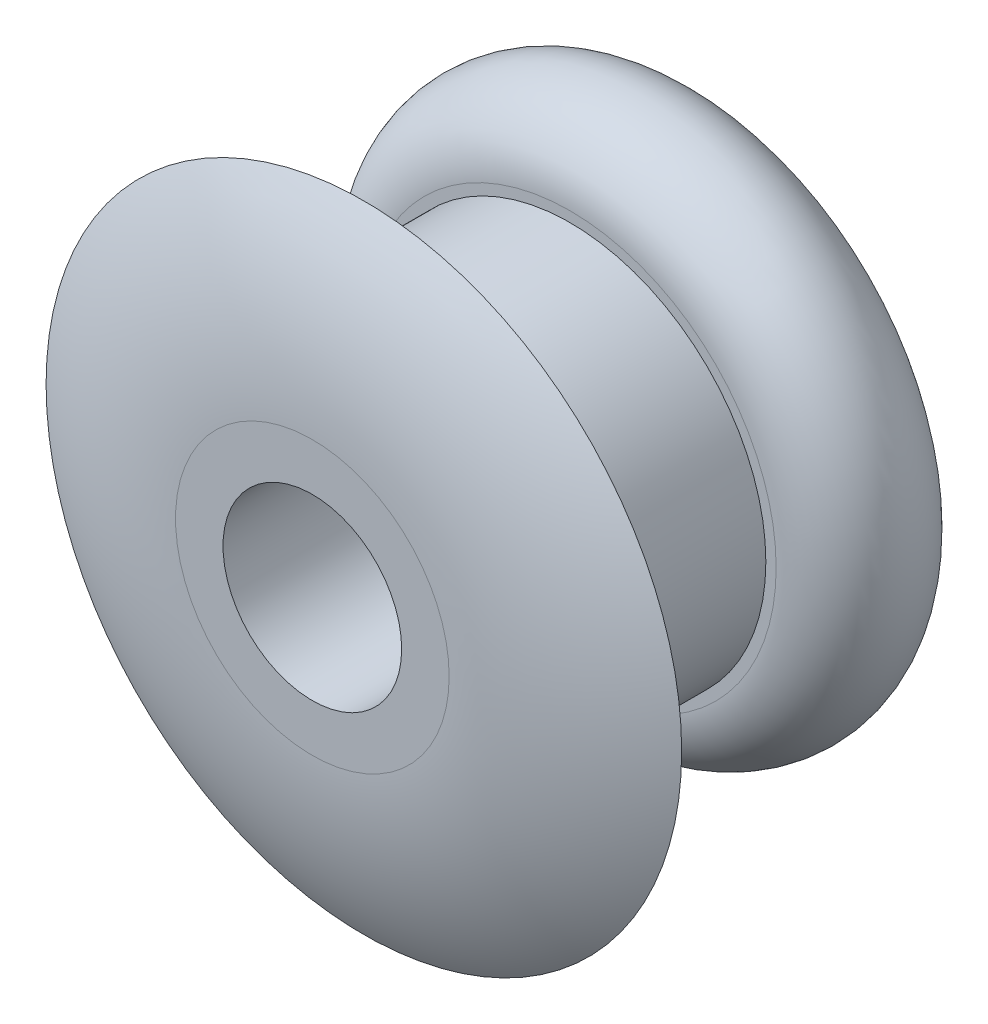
ISO-10303-21;
HEADER;
FILE_DESCRIPTION(('STEP AP214'),'2;1');
FILE_NAME('part.step','',(''),(''),'','','');
FILE_SCHEMA(('AUTOMOTIVE_DESIGN { 1 0 10303 214 1 1 1 1 }'));
ENDSEC;
DATA;
#1=APPLICATION_CONTEXT('core data for automotive mechanical design processes');
#2=APPLICATION_PROTOCOL_DEFINITION('international standard','automotive_design',2000,#1);
#3=PRODUCT_CONTEXT('',#1,'mechanical');
#4=PRODUCT('Part','Part','',(#3));
#5=PRODUCT_RELATED_PRODUCT_CATEGORY('part','',(#4));
#6=PRODUCT_DEFINITION_FORMATION('','',#4);
#7=PRODUCT_DEFINITION_CONTEXT('part definition',#1,'design');
#8=PRODUCT_DEFINITION('design','',#6,#7);
#9=PRODUCT_DEFINITION_SHAPE('','',#8);
#10=(LENGTH_UNIT() NAMED_UNIT(*) SI_UNIT(.MILLI.,.METRE.));
#11=(NAMED_UNIT(*) PLANE_ANGLE_UNIT() SI_UNIT($,.RADIAN.));
#12=(NAMED_UNIT(*) SI_UNIT($,.STERADIAN.) SOLID_ANGLE_UNIT());
#13=UNCERTAINTY_MEASURE_WITH_UNIT(LENGTH_MEASURE(1.E-05),#10,'distance_accuracy_value','');
#14=(GEOMETRIC_REPRESENTATION_CONTEXT(3) GLOBAL_UNCERTAINTY_ASSIGNED_CONTEXT((#13)) GLOBAL_UNIT_ASSIGNED_CONTEXT((#10,
#11,#12)) REPRESENTATION_CONTEXT('',''));
#15=CARTESIAN_POINT('',(0.,0.,0.));
#16=DIRECTION('',(0.,0.,1.));
#17=DIRECTION('',(1.,0.,0.));
#18=AXIS2_PLACEMENT_3D('',#15,#16,#17);
#19=CARTESIAN_POINT('',(0.,0.,-5.));
#20=DIRECTION('',(0.,0.,1.));
#21=DIRECTION('',(1.,0.,0.));
#22=AXIS2_PLACEMENT_3D('',#19,#20,#21);
#23=DEGENERATE_TOROIDAL_SURFACE('',#22,1.99108656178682,5.,.T.);
#24=CARTESIAN_POINT('',(0.,0.,0.));
#25=DIRECTION('',(0.,0.,1.));
#26=DIRECTION('',(1.,0.,0.));
#27=AXIS2_PLACEMENT_3D('',#24,#25,#26);
#28=CIRCLE('',#27,1.99108656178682);
#29=CARTESIAN_POINT('',(1.99108656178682,0.,0.));
#30=VERTEX_POINT('',#29);
#31=EDGE_CURVE('E63',#30,#30,#28,.T.);
#32=ORIENTED_EDGE('',*,*,#31,.F.);
#33=EDGE_LOOP('',(#32));
#34=FACE_BOUND('',#33,.T.);
#35=CARTESIAN_POINT('',(0.,0.,-0.75));
#36=DIRECTION('',(0.,0.,1.));
#37=DIRECTION('',(1.,0.,0.));
#38=AXIS2_PLACEMENT_3D('',#35,#36,#37);
#39=CIRCLE('',#38,4.625);
#40=CARTESIAN_POINT('',(4.625,0.,-0.75));
#41=VERTEX_POINT('',#40);
#42=EDGE_CURVE('E10',#41,#41,#39,.T.);
#43=ORIENTED_EDGE('',*,*,#42,.T.);
#44=EDGE_LOOP('',(#43));
#45=FACE_BOUND('',#44,.T.);
#46=ADVANCED_FACE('F29',(#34,#45),#23,.T.);
#47=CARTESIAN_POINT('',(0.,2.85,-0.75));
#48=DIRECTION('',(0.,0.,1.));
#49=DIRECTION('',(1.,0.,0.));
#50=AXIS2_PLACEMENT_3D('',#47,#48,#49);
#51=PLANE('',#50);
#52=ORIENTED_EDGE('',*,*,#42,.F.);
#53=EDGE_LOOP('',(#52));
#54=FACE_BOUND('',#53,.T.);
#55=CARTESIAN_POINT('',(0.,0.,-0.75));
#56=DIRECTION('',(0.,0.,1.));
#57=DIRECTION('',(1.,0.,0.));
#58=AXIS2_PLACEMENT_3D('',#55,#56,#57);
#59=CIRCLE('',#58,2.85);
#60=CARTESIAN_POINT('',(2.85,0.,-0.75));
#61=VERTEX_POINT('',#60);
#62=EDGE_CURVE('E35',#61,#61,#59,.T.);
#63=ORIENTED_EDGE('',*,*,#62,.T.);
#64=EDGE_LOOP('',(#63));
#65=FACE_BOUND('',#64,.T.);
#66=ADVANCED_FACE('F70',(#54,#65),#51,.F.);
#67=CARTESIAN_POINT('',(0.,0.,4.53935010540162));
#68=DIRECTION('',(0.,0.,1.));
#69=DIRECTION('',(1.,0.,0.));
#70=AXIS2_PLACEMENT_3D('',#67,#68,#69);
#71=CYLINDRICAL_SURFACE('',#70,2.85);
#72=ORIENTED_EDGE('',*,*,#62,.F.);
#73=EDGE_LOOP('',(#72));
#74=FACE_BOUND('',#73,.T.);
#75=CARTESIAN_POINT('',(0.,0.,-3.75));
#76=DIRECTION('',(0.,0.,1.));
#77=DIRECTION('',(1.,0.,0.));
#78=AXIS2_PLACEMENT_3D('',#75,#76,#77);
#79=CIRCLE('',#78,2.85);
#80=CARTESIAN_POINT('',(2.85,0.,-3.75));
#81=VERTEX_POINT('',#80);
#82=EDGE_CURVE('E39',#81,#81,#79,.T.);
#83=ORIENTED_EDGE('',*,*,#82,.T.);
#84=EDGE_LOOP('',(#83));
#85=FACE_BOUND('',#84,.T.);
#86=ADVANCED_FACE('F74',(#74,#85),#71,.T.);
#87=CARTESIAN_POINT('',(0.,2.85,-3.75));
#88=DIRECTION('',(0.,0.,-1.));
#89=DIRECTION('',(-1.,0.,0.));
#90=AXIS2_PLACEMENT_3D('',#87,#88,#89);
#91=PLANE('',#90);
#92=ORIENTED_EDGE('',*,*,#82,.F.);
#93=EDGE_LOOP('',(#92));
#94=FACE_BOUND('',#93,.T.);
#95=CARTESIAN_POINT('',(0.,0.,-3.75));
#96=DIRECTION('',(0.,0.,1.));
#97=DIRECTION('',(1.,0.,0.));
#98=AXIS2_PLACEMENT_3D('',#95,#96,#97);
#99=CIRCLE('',#98,3.);
#100=CARTESIAN_POINT('',(3.,0.,-3.75));
#101=VERTEX_POINT('',#100);
#102=EDGE_CURVE('E43',#101,#101,#99,.T.);
#103=ORIENTED_EDGE('',*,*,#102,.T.);
#104=EDGE_LOOP('',(#103));
#105=FACE_BOUND('',#104,.T.);
#106=ADVANCED_FACE('F79',(#94,#105),#91,.F.);
#107=CARTESIAN_POINT('',(0.,0.,-4.75));
#108=DIRECTION('',(0.,0.,1.));
#109=DIRECTION('',(1.,0.,0.));
#110=AXIS2_PLACEMENT_3D('',#107,#108,#109);
#111=TOROIDAL_SURFACE('',#110,3.,1.);
#112=ORIENTED_EDGE('',*,*,#102,.F.);
#113=EDGE_LOOP('',(#112));
#114=FACE_BOUND('',#113,.T.);
#115=CARTESIAN_POINT('',(0.,0.,-5.75));
#116=DIRECTION('',(0.,0.,1.));
#117=DIRECTION('',(1.,0.,0.));
#118=AXIS2_PLACEMENT_3D('',#115,#116,#117);
#119=CIRCLE('',#118,3.);
#120=CARTESIAN_POINT('',(3.,0.,-5.75));
#121=VERTEX_POINT('',#120);
#122=EDGE_CURVE('E48',#121,#121,#119,.T.);
#123=ORIENTED_EDGE('',*,*,#122,.T.);
#124=EDGE_LOOP('',(#123));
#125=FACE_BOUND('',#124,.T.);
#126=ADVANCED_FACE('F85',(#114,#125),#111,.T.);
#127=CARTESIAN_POINT('',(0.,1.73,-5.75));
#128=DIRECTION('',(0.,0.,1.));
#129=DIRECTION('',(1.,0.,0.));
#130=AXIS2_PLACEMENT_3D('',#127,#128,#129);
#131=PLANE('',#130);
#132=ORIENTED_EDGE('',*,*,#122,.F.);
#133=EDGE_LOOP('',(#132));
#134=FACE_BOUND('',#133,.T.);
#135=CARTESIAN_POINT('',(0.,0.,-5.75));
#136=DIRECTION('',(0.,0.,1.));
#137=DIRECTION('',(1.,0.,0.));
#138=AXIS2_PLACEMENT_3D('',#135,#136,#137);
#139=CIRCLE('',#138,1.73);
#140=CARTESIAN_POINT('',(1.73,0.,-5.75));
#141=VERTEX_POINT('',#140);
#142=EDGE_CURVE('E51',#141,#141,#139,.T.);
#143=ORIENTED_EDGE('',*,*,#142,.T.);
#144=EDGE_LOOP('',(#143));
#145=FACE_BOUND('',#144,.T.);
#146=ADVANCED_FACE('F89',(#134,#145),#131,.F.);
#147=CARTESIAN_POINT('',(0.,0.,4.53935010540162));
#148=DIRECTION('',(0.,0.,1.));
#149=DIRECTION('',(1.,0.,0.));
#150=AXIS2_PLACEMENT_3D('',#147,#148,#149);
#151=CYLINDRICAL_SURFACE('',#150,1.73);
#152=ORIENTED_EDGE('',*,*,#142,.F.);
#153=EDGE_LOOP('',(#152));
#154=FACE_BOUND('',#153,.T.);
#155=CARTESIAN_POINT('',(0.,0.,-4.5));
#156=DIRECTION('',(0.,0.,1.));
#157=DIRECTION('',(1.,0.,0.));
#158=AXIS2_PLACEMENT_3D('',#155,#156,#157);
#159=CIRCLE('',#158,1.73);
#160=CARTESIAN_POINT('',(1.73,0.,-4.5));
#161=VERTEX_POINT('',#160);
#162=EDGE_CURVE('E54',#161,#161,#159,.T.);
#163=ORIENTED_EDGE('',*,*,#162,.T.);
#164=EDGE_LOOP('',(#163));
#165=FACE_BOUND('',#164,.T.);
#166=ADVANCED_FACE('F93',(#154,#165),#151,.F.);
#167=CARTESIAN_POINT('',(0.,1.73,-4.5));
#168=DIRECTION('',(0.,0.,1.));
#169=DIRECTION('',(1.,0.,0.));
#170=AXIS2_PLACEMENT_3D('',#167,#168,#169);
#171=PLANE('',#170);
#172=ORIENTED_EDGE('',*,*,#162,.F.);
#173=EDGE_LOOP('',(#172));
#174=FACE_BOUND('',#173,.T.);
#175=CARTESIAN_POINT('',(0.,0.,-4.5));
#176=DIRECTION('',(0.,0.,1.));
#177=DIRECTION('',(1.,0.,0.));
#178=AXIS2_PLACEMENT_3D('',#175,#176,#177);
#179=CIRCLE('',#178,1.3);
#180=CARTESIAN_POINT('',(1.3,0.,-4.5));
#181=VERTEX_POINT('',#180);
#182=EDGE_CURVE('E57',#181,#181,#179,.T.);
#183=ORIENTED_EDGE('',*,*,#182,.T.);
#184=EDGE_LOOP('',(#183));
#185=FACE_BOUND('',#184,.T.);
#186=ADVANCED_FACE('F97',(#174,#185),#171,.F.);
#187=CARTESIAN_POINT('',(0.,0.,4.53935010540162));
#188=DIRECTION('',(0.,0.,1.));
#189=DIRECTION('',(1.,0.,0.));
#190=AXIS2_PLACEMENT_3D('',#187,#188,#189);
#191=CYLINDRICAL_SURFACE('',#190,1.3);
#192=ORIENTED_EDGE('',*,*,#182,.F.);
#193=EDGE_LOOP('',(#192));
#194=FACE_BOUND('',#193,.T.);
#195=CARTESIAN_POINT('',(0.,0.,0.));
#196=DIRECTION('',(0.,0.,1.));
#197=DIRECTION('',(1.,0.,0.));
#198=AXIS2_PLACEMENT_3D('',#195,#196,#197);
#199=CIRCLE('',#198,1.3);
#200=CARTESIAN_POINT('',(1.3,0.,0.));
#201=VERTEX_POINT('',#200);
#202=EDGE_CURVE('E60',#201,#201,#199,.T.);
#203=ORIENTED_EDGE('',*,*,#202,.T.);
#204=EDGE_LOOP('',(#203));
#205=FACE_BOUND('',#204,.T.);
#206=ADVANCED_FACE('F101',(#194,#205),#191,.F.);
#207=CARTESIAN_POINT('',(0.,1.3,0.));
#208=DIRECTION('',(0.,0.,-1.));
#209=DIRECTION('',(-1.,0.,0.));
#210=AXIS2_PLACEMENT_3D('',#207,#208,#209);
#211=PLANE('',#210);
#212=ORIENTED_EDGE('',*,*,#202,.F.);
#213=EDGE_LOOP('',(#212));
#214=FACE_BOUND('',#213,.T.);
#215=ORIENTED_EDGE('',*,*,#31,.T.);
#216=EDGE_LOOP('',(#215));
#217=FACE_BOUND('',#216,.T.);
#218=ADVANCED_FACE('F67',(#214,#217),#211,.F.);
#219=CLOSED_SHELL('',(#46,#66,#86,#106,#126,#146,#166,#186,#206,#218));
#220=MANIFOLD_SOLID_BREP('B2',#219);
#221=ADVANCED_BREP_SHAPE_REPRESENTATION('',(#18,#220),#14);
#222=SHAPE_DEFINITION_REPRESENTATION(#9,#221);
ENDSEC;
END-ISO-10303-21;
